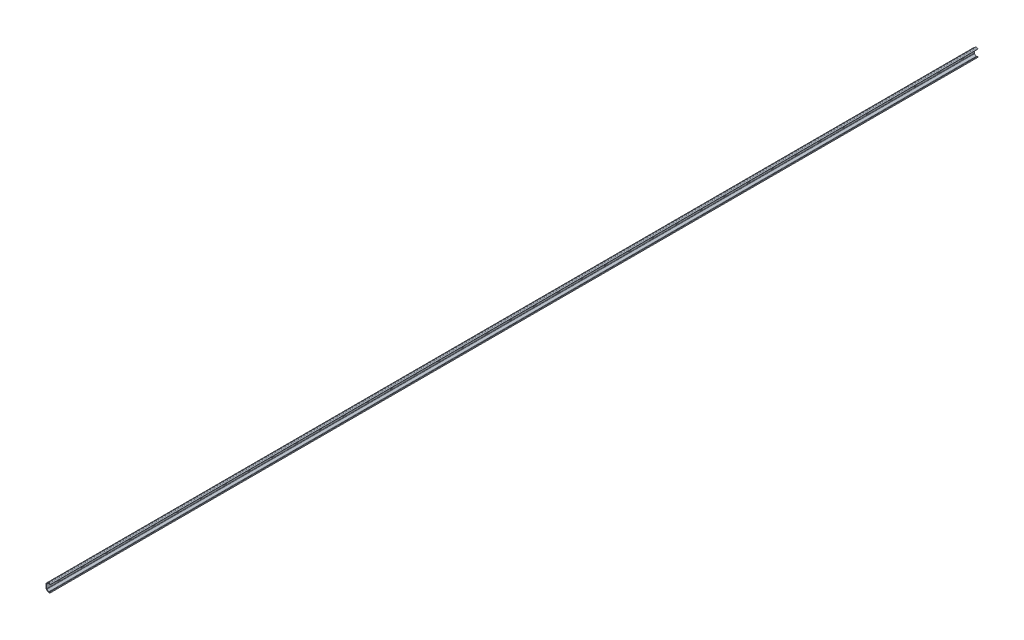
from build123d import *

# Parameters (mm, degrees)
EXTRUDE1_DEPTH  = 3120
EXTRUDE2_DEPTH  = 3121.060517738
LPATTERN1_COUNT = 39
LPATTERN1_PITCH = 80


with BuildPart() as part:
    # Sketch1 → Extrude1 (new body)
    with BuildSketch(Plane.XY):
        with BuildLine():
            Line((13.566058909, -10.161082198), (15, -12.208962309))
            Line((15, -12.208962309), (12.158978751, -14.198266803))
            ThreePointArc((12.158978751, -14.198266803), (10, -14.878990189), (7.841021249, -14.198266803))
            Line((7.841021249, -14.198266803), (2.07234263, -10.158994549))
            ThreePointArc((2.07234263, -10.158994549), (0.593144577, -8.506805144), (0, -6.37))
            Line((0, -6.37), (0, 6.37))
            ThreePointArc((0, 6.37), (0.551933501, 8.529345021), (2.07234263, 10.158994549))
            Line((2.07234263, 10.158994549), (7.841021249, 14.198266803))
            ThreePointArc((7.841021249, 14.198266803), (10, 14.878990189), (12.158978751, 14.198266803))
            Line((12.158978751, 14.198266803), (15, 12.208962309))
            Line((15, 12.208962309), (13.566058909, 10.161082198))
            Line((13.566058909, 10.161082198), (10.861016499, 12.055173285))
            ThreePointArc((10.861016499, 12.055173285), (10, 12.326650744), (9.138983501, 12.055173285))
            Line((9.138983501, 12.055173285), (3.254206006, 7.934607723))
            ThreePointArc((3.254206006, 7.934607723), (2.672861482, 7.25075677), (2.5, 6.37))
            Line((2.5, 6.37), (2.5, -6.37))
            ThreePointArc((2.5, -6.37), (2.698391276, -7.238450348), (3.254206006, -7.934607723))
            Line((3.254206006, -7.934607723), (9.138983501, -12.055173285))
            ThreePointArc((9.138983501, -12.055173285), (10, -12.326650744), (10.861016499, -12.055173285))
            Line((10.861016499, -12.055173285), (13.566058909, -10.161082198))
        make_face()
    extrude(amount=-EXTRUDE1_DEPTH)

    # Sketch3 → Extrude2 (cut, through all)
    with BuildSketch(Plane(origin=(2.5, 0, 0), x_dir=(0, 0, -1), z_dir=(1, 0, 0))):
        with BuildLine():
            Line((37.5, 3), (42.5, 3))
            ThreePointArc((42.5, 3), (45.5, 0), (42.5, -3))
            Line((42.5, -3), (37.5, -3))
            ThreePointArc((37.5, -3), (34.5, 0), (37.5, 3))
        make_face()
    extrude2 = extrude(amount=-EXTRUDE2_DEPTH, mode=Mode.SUBTRACT)

    # LPattern1: Extrude2 ×39
    with Locations(*[(0, 0, -i * LPATTERN1_PITCH) for i in range(1, LPATTERN1_COUNT)]):
        add(extrude2, mode=Mode.SUBTRACT)


solid = part.part
